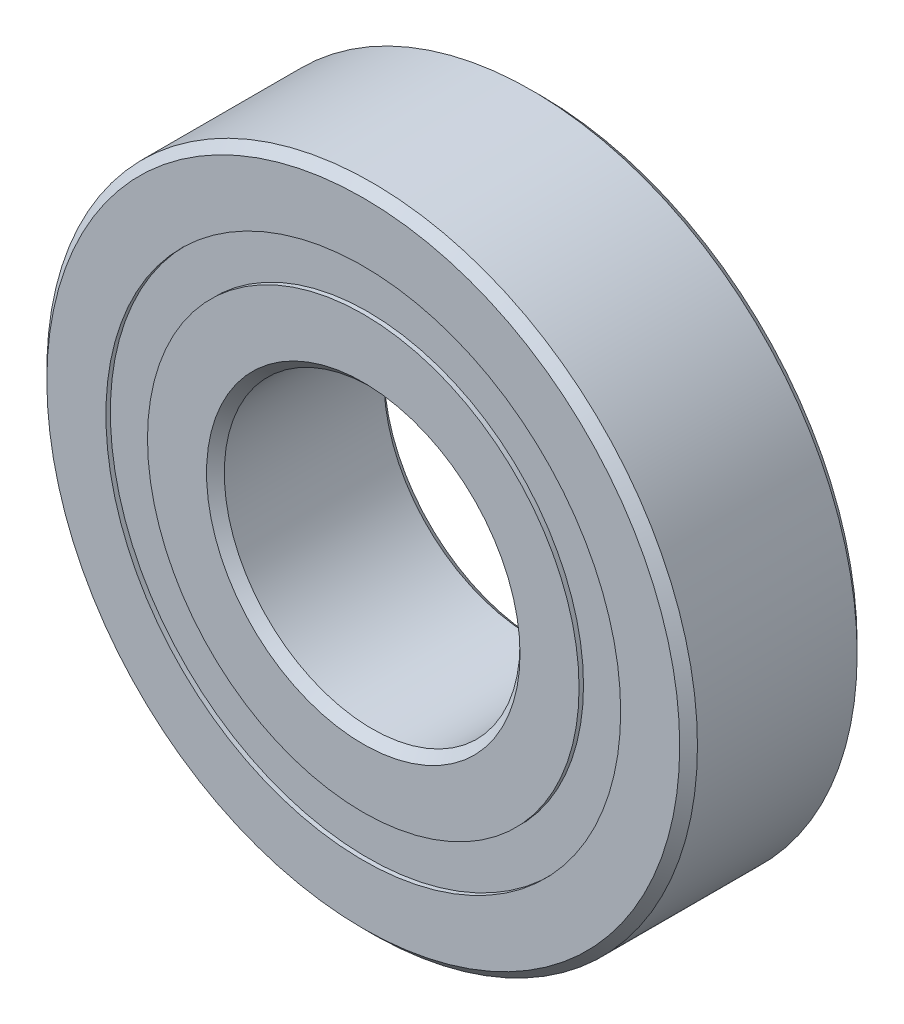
from build123d import *

# Parameters (mm, degrees)
CIRPATTERN1_COUNT = 12
SKETCH5_W         = 1.342550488
SKETCH5_H         = 1.406593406


with BuildPart() as part:
    # Sketch1 → Revolve1 (revolve)
    with BuildSketch(Plane(origin=(0, 0, 0), x_dir=(0, 0, -1), z_dir=(1, 0, 0)), mode=Mode.PRIVATE) as revolve1_sk:
        with BuildLine():
            Line((2.7, 11), (-2.7, 11))
            Line((-2.7, 11), (-3, 10.7))
            Line((-3, 10.7), (-3, 8.703296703))
            Line((-3, 8.703296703), (-1.333333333, 8.703296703))
            ThreePointArc((-1.333333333, 8.703296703), (0, 9.507449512), (1.333333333, 8.703296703))
            Line((1.333333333, 8.703296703), (3, 8.703296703))
            Line((3, 8.703296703), (3, 10.7))
            Line((3, 10.7), (2.7, 11))
        make_face()
    revolve(revolve1_sk.sketch.rotate(Axis((0, 0, 3), (0, 0, -1)), 90), axis=Axis((0, 0, 3), (0, 0, -1)))


with BuildPart() as body_2:
    # Sketch3 → Revolve3 (revolve)
    with BuildSketch(Plane(origin=(0, 0, 0), x_dir=(0, 0, -1), z_dir=(1, 0, 0)), mode=Mode.PRIVATE) as revolve3_sk:
        with BuildLine():
            Line((-3, 7.296703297), (-1.333333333, 7.296703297))
            ThreePointArc((-1.333333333, 7.296703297), (0, 6.492550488), (1.333333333, 7.296703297))
            Line((1.333333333, 7.296703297), (3, 7.296703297))
            Line((3, 7.296703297), (3, 5.3))
            Line((3, 5.3), (2.7, 5))
            Line((2.7, 5), (-2.7, 5))
            Line((-2.7, 5), (-3, 5.3))
            Line((-3, 5.3), (-3, 7.296703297))
        make_face()
    revolve(revolve3_sk.sketch.rotate(Axis((0, 0, 3), (0, 0, -1)), 90), axis=Axis((0, 0, 3), (0, 0, -1)))


with BuildPart() as body_3:
    # Sketch4 → Revolve4 (revolve)
    with BuildSketch(Plane(origin=(0, 0, 0), x_dir=(0, 0, -1), z_dir=(1, 0, 0))):
        with BuildLine():
            Line((-1.507449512, 8), (1.507449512, 8))
            ThreePointArc((1.507449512, 8), (0, 9.507449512), (-1.507449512, 8))
        make_face()
    revolve(axis=Axis((0, 8, 1.507449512), (0, 0, -1)))


with BuildPart() as cirpattern1_1:
    # CirPattern1: pattern copy
    add(body_3.part.rotate(Axis((0, 0, 0), (0, 0, 1)), 1 * 360 / CIRPATTERN1_COUNT))


with BuildPart() as cirpattern1_2:
    # CirPattern1: pattern copy
    add(body_3.part.rotate(Axis((0, 0, 0), (0, 0, 1)), 2 * 360 / CIRPATTERN1_COUNT))


with BuildPart() as cirpattern1_3:
    # CirPattern1: pattern copy
    add(body_3.part.rotate(Axis((0, 0, 0), (0, 0, 1)), 3 * 360 / CIRPATTERN1_COUNT))


with BuildPart() as cirpattern1_4:
    # CirPattern1: pattern copy
    add(body_3.part.rotate(Axis((0, 0, 0), (0, 0, 1)), 4 * 360 / CIRPATTERN1_COUNT))


with BuildPart() as cirpattern1_5:
    # CirPattern1: pattern copy
    add(body_3.part.rotate(Axis((0, 0, 0), (0, 0, 1)), 5 * 360 / CIRPATTERN1_COUNT))


with BuildPart() as cirpattern1_6:
    # CirPattern1: pattern copy
    add(body_3.part.rotate(Axis((0, 0, 0), (0, 0, 1)), 6 * 360 / CIRPATTERN1_COUNT))


with BuildPart() as cirpattern1_7:
    # CirPattern1: pattern copy
    add(body_3.part.rotate(Axis((0, 0, 0), (0, 0, 1)), 7 * 360 / CIRPATTERN1_COUNT))


with BuildPart() as cirpattern1_8:
    # CirPattern1: pattern copy
    add(body_3.part.rotate(Axis((0, 0, 0), (0, 0, 1)), 8 * 360 / CIRPATTERN1_COUNT))


with BuildPart() as cirpattern1_9:
    # CirPattern1: pattern copy
    add(body_3.part.rotate(Axis((0, 0, 0), (0, 0, 1)), 9 * 360 / CIRPATTERN1_COUNT))


with BuildPart() as cirpattern1_10:
    # CirPattern1: pattern copy
    add(body_3.part.rotate(Axis((0, 0, 0), (0, 0, 1)), 10 * 360 / CIRPATTERN1_COUNT))


with BuildPart() as cirpattern1_11:
    # CirPattern1: pattern copy
    add(body_3.part.rotate(Axis((0, 0, 0), (0, 0, 1)), 11 * 360 / CIRPATTERN1_COUNT))


with BuildPart() as body_15:
    # Sketch5 → Revolve5 (revolve)
    with BuildSketch(Plane(origin=(0, 0, 0), x_dir=(0, 0, -1), z_dir=(1, 0, 0)), mode=Mode.PRIVATE) as revolve5_sk:
        with Locations((-2.178724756, 8)):
            Rectangle(SKETCH5_W, SKETCH5_H)
        with Locations((2.178724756, 8)):
            Rectangle(SKETCH5_W, SKETCH5_H)
    revolve(revolve5_sk.sketch.rotate(Axis((0, 0, 3), (0, 0, -1)), 90), axis=Axis((0, 0, 3), (0, 0, -1)))


solid = Compound([part.part, body_2.part, body_3.part, cirpattern1_1.part, cirpattern1_2.part, cirpattern1_3.part, cirpattern1_4.part, cirpattern1_5.part, cirpattern1_6.part, cirpattern1_7.part, cirpattern1_8.part, cirpattern1_9.part, cirpattern1_10.part, cirpattern1_11.part, body_15.part])
